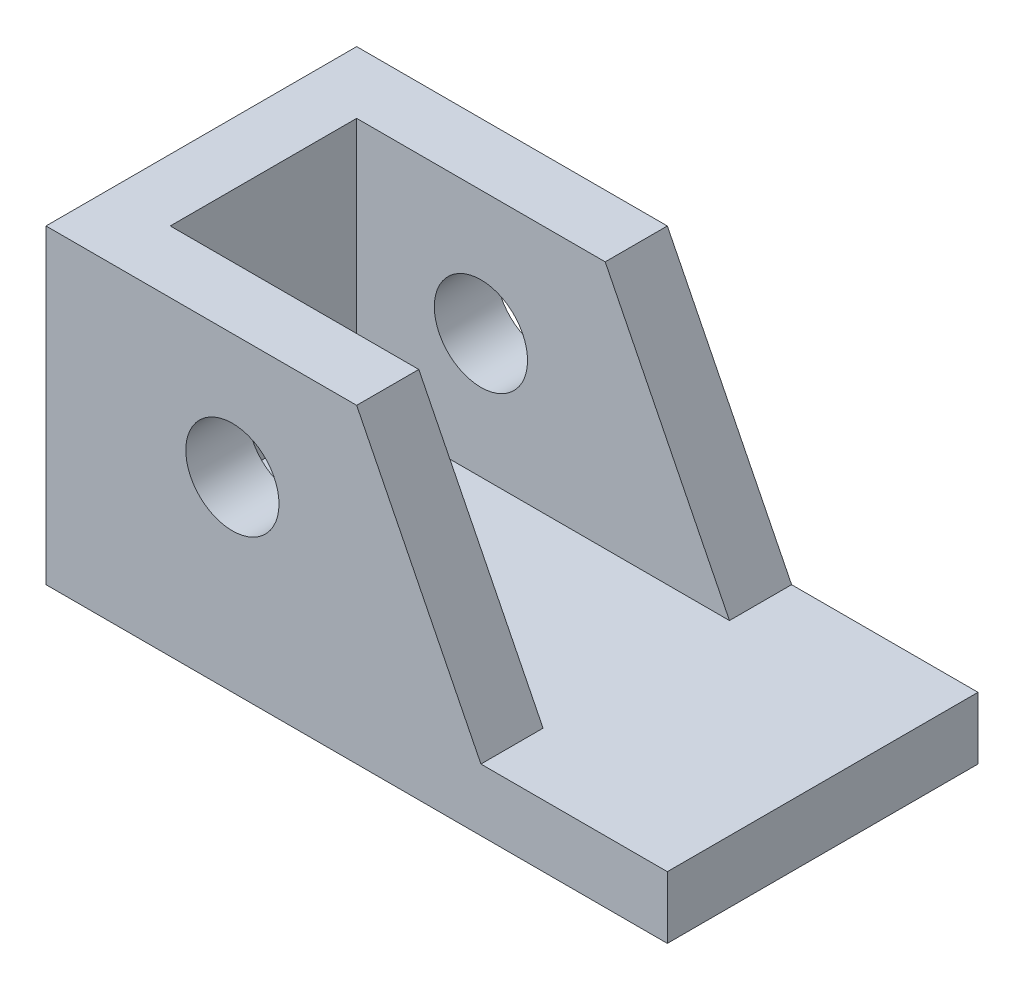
from build123d import *

# Parameters (mm, degrees)
SKETCH_1_W          = 100
SKETCH_1_H          = 50
EXTRUDE_1_DEPTH     = 50
CUT_EXTRUDE_1_DEPTH = 123.474487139
SKETCH_4_W          = 90
SKETCH_4_H          = 30
CUT_EXTRUDE_2_DEPTH = 40
SKETCH_5_R          = 7.5
CUT_EXTRUDE_3_DEPTH = 123.474487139


with BuildPart() as part:
    # Sketch 1 → Extrude 1 (new body)
    with BuildSketch(Plane(origin=(0, 0, 0), x_dir=(1, 0, 0), z_dir=(0, 1, 0))):
        with Locations((50, 25)):
            Rectangle(SKETCH_1_W, SKETCH_1_H)
    extrude(amount=EXTRUDE_1_DEPTH)

    # Sketch 3 → Cut-Extrude 1 (cut, through all)
    with BuildSketch(Plane.XY):
        Polygon((100, 10), (70, 10), (50, 50), (100, 50), align=None)
    extrude(amount=-CUT_EXTRUDE_1_DEPTH, mode=Mode.SUBTRACT)

    # Sketch 4 → Cut-Extrude 2 (cut)
    with BuildSketch(Plane(origin=(0, 50, 0), x_dir=(1, 0, 0), z_dir=(0, 1, 0))):
        with Locations((55, 25)):
            Rectangle(SKETCH_4_W, SKETCH_4_H)
    extrude(amount=-CUT_EXTRUDE_2_DEPTH, mode=Mode.SUBTRACT)

    # Sketch 5 → Cut-Extrude 3 (cut, through all)
    with BuildSketch(Plane.XY):
        with Locations((30, 30)):
            Circle(SKETCH_5_R)
    extrude(amount=-CUT_EXTRUDE_3_DEPTH, mode=Mode.SUBTRACT)


solid = part.part
